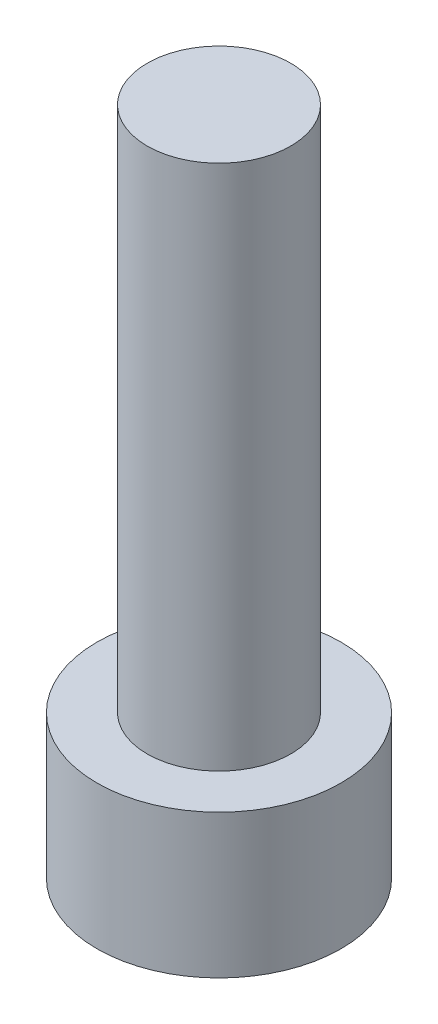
from build123d import *

# Parameters (mm, degrees)
SKETCH_1_R          = 5.1
EXTRUDE_1_DEPTH     = 6
SKETCH_2_R          = 3
EXTRUDE_2_DEPTH     = 22
CUT_EXTRUDE_1_DEPTH = 3


with BuildPart() as part:
    # Sketch 1 → Extrude 1 (new body)
    with BuildSketch(Plane(origin=(0, 0, 0), x_dir=(1, 0, 0), z_dir=(0, 1, 0))):
        with Locations(Location((0, 0, 0), (0, 0, 270))):
            Circle(SKETCH_1_R)
    extrude(amount=EXTRUDE_1_DEPTH)

    # Sketch 2 → Extrude 2 (add)
    with BuildSketch(Plane(origin=(0, 6, 0), x_dir=(1, 0, 0), z_dir=(0, 1, 0))):
        with Locations(Location((0, 0, 0), (0, 0, 270))):
            Circle(SKETCH_2_R)
    extrude(amount=EXTRUDE_2_DEPTH)

    # Sketch 3 → Cut-Extrude 1 (cut)
    with BuildSketch(Plane.XZ):
        Polygon((2.357121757, -1.666526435), (2.621815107, 1.208064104), (0.26469335, 2.874590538), (-2.357121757, 1.666526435), (-2.621815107, -1.208064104), (-0.26469335, -2.874590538), align=None)
    extrude(amount=-CUT_EXTRUDE_1_DEPTH, mode=Mode.SUBTRACT)


solid = part.part
